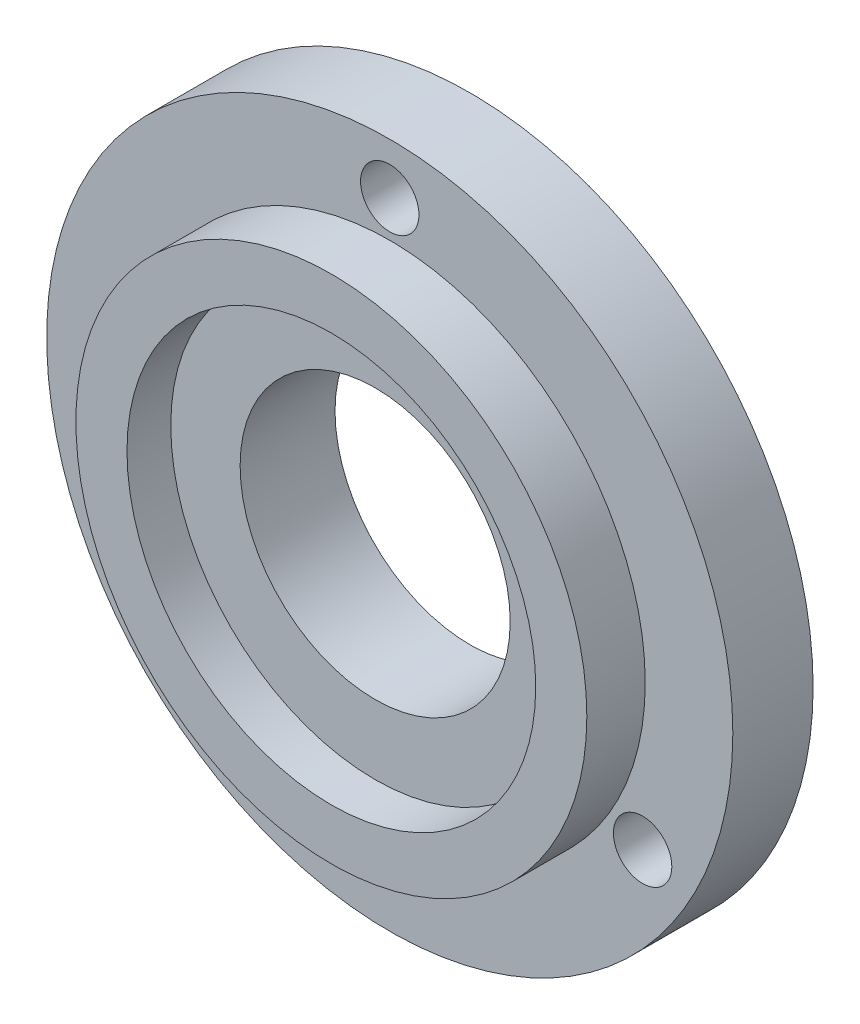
from build123d import *

# Parameters (mm, degrees)
ESQUISSE1_R                  = 23.5
BASE_EXTRUSION_DEPTH         = 9.5
ENL_V_START                  = -4
ESQUISSE2_R                  = 23.5
ESQUISSE2_R_2                = 17.5
ENL_V_MAT_EXTRU_1_DEPTH      = 4
ESQUISSE3_R                  = 14
ENL_V_MAT_EXTRU_2_DEPTH      = 3
ESQUISSE5_R                  = 9.25
ENL_V_MAT_EXTRU_3_DEPTH      = 35.565155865
ESQUISSE7_R                  = 2
ENL_V_MAT_EXTRU_4_DEPTH      = 35.565155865
R_P_TITION_CIRCULAIRE1_COUNT = 3


with BuildPart() as part:
    # Esquisse1 → Base-Extrusion (new body)
    with BuildSketch(Plane.XY):
        Circle(ESQUISSE1_R)
    extrude(amount=BASE_EXTRUSION_DEPTH)

    # Esquisse2 → Enl_v. mat.-Extru.1 (cut)
    with BuildSketch(Plane.XY.offset(9.5).offset(ENL_V_START)):
        Circle(ESQUISSE2_R)
        Circle(ESQUISSE2_R_2, mode=Mode.SUBTRACT)
    extrude(amount=ENL_V_MAT_EXTRU_1_DEPTH, mode=Mode.SUBTRACT)

    # Esquisse3 → Enl_v. mat.-Extru.2 (cut)
    with BuildSketch(Plane.XY.offset(9.5)):
        Circle(ESQUISSE3_R)
    extrude(amount=-ENL_V_MAT_EXTRU_2_DEPTH, mode=Mode.SUBTRACT)

    # Esquisse5 → Enl_v. mat.-Extru.3 (cut, through all)
    with BuildSketch(Plane(origin=(0, 0, 0), x_dir=(-1, 0, 0), z_dir=(0, 0, -1))):
        Circle(ESQUISSE5_R)
    extrude(amount=-ENL_V_MAT_EXTRU_3_DEPTH, mode=Mode.SUBTRACT)

    # Esquisse7 → Enl_v. mat.-Extru.4 (cut, through all)
    with BuildSketch(Plane(origin=(0, 0, 0), x_dir=(-1, 0, 0), z_dir=(0, 0, -1))):
        with Locations((0, 20)):
            Circle(ESQUISSE7_R)
    enl_v_mat_extru_4 = extrude(amount=-ENL_V_MAT_EXTRU_4_DEPTH, mode=Mode.SUBTRACT)

    # R_p_tition circulaire1: Enl_v. mat.-Extru.4 ×3 about axis
    r_p_tition_circulaire1_axis = Axis((0, 0, 0), (0, 0, 1))
    for i in range(1, R_P_TITION_CIRCULAIRE1_COUNT):
        add(enl_v_mat_extru_4.rotate(r_p_tition_circulaire1_axis, i * 360 / R_P_TITION_CIRCULAIRE1_COUNT), mode=Mode.SUBTRACT)


solid = part.part
